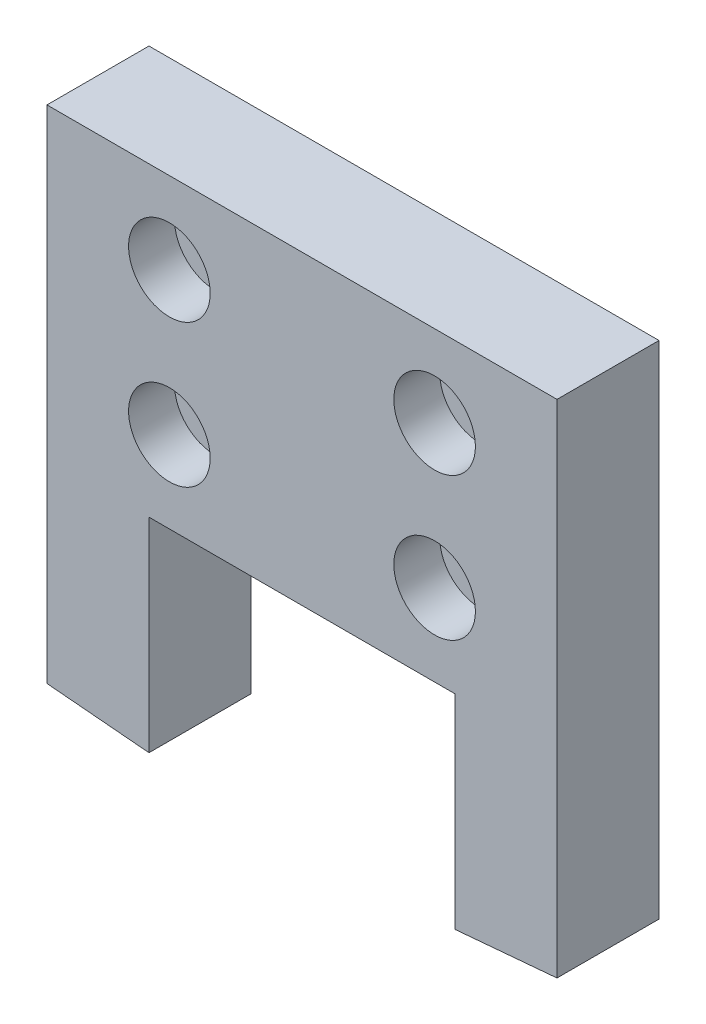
ISO-10303-21;
HEADER;
FILE_DESCRIPTION(('STEP AP214'),'2;1');
FILE_NAME('part.step','',(''),(''),'','','');
FILE_SCHEMA(('AUTOMOTIVE_DESIGN { 1 0 10303 214 1 1 1 1 }'));
ENDSEC;
DATA;
#1=APPLICATION_CONTEXT('core data for automotive mechanical design processes');
#2=APPLICATION_PROTOCOL_DEFINITION('international standard','automotive_design',2000,#1);
#3=PRODUCT_CONTEXT('',#1,'mechanical');
#4=PRODUCT('Part','Part','',(#3));
#5=PRODUCT_RELATED_PRODUCT_CATEGORY('part','',(#4));
#6=PRODUCT_DEFINITION_FORMATION('','',#4);
#7=PRODUCT_DEFINITION_CONTEXT('part definition',#1,'design');
#8=PRODUCT_DEFINITION('design','',#6,#7);
#9=PRODUCT_DEFINITION_SHAPE('','',#8);
#10=(LENGTH_UNIT() NAMED_UNIT(*) SI_UNIT(.MILLI.,.METRE.));
#11=(NAMED_UNIT(*) PLANE_ANGLE_UNIT() SI_UNIT($,.RADIAN.));
#12=(NAMED_UNIT(*) SI_UNIT($,.STERADIAN.) SOLID_ANGLE_UNIT());
#13=UNCERTAINTY_MEASURE_WITH_UNIT(LENGTH_MEASURE(1.E-05),#10,'distance_accuracy_value','');
#14=(GEOMETRIC_REPRESENTATION_CONTEXT(3) GLOBAL_UNCERTAINTY_ASSIGNED_CONTEXT((#13)) GLOBAL_UNIT_ASSIGNED_CONTEXT((#10,
#11,#12)) REPRESENTATION_CONTEXT('',''));
#15=CARTESIAN_POINT('',(0.,0.,0.));
#16=DIRECTION('',(0.,0.,1.));
#17=DIRECTION('',(1.,0.,0.));
#18=AXIS2_PLACEMENT_3D('',#15,#16,#17);
#19=CARTESIAN_POINT('',(12.,28.,10.));
#20=DIRECTION('',(0.,0.,-1.));
#21=DIRECTION('',(-1.,0.,0.));
#22=AXIS2_PLACEMENT_3D('',#19,#20,#21);
#23=CYLINDRICAL_SURFACE('',#22,2.25);
#24=CARTESIAN_POINT('',(12.,28.,0.));
#25=DIRECTION('',(0.,0.,1.));
#26=DIRECTION('',(1.,0.,0.));
#27=AXIS2_PLACEMENT_3D('',#24,#25,#26);
#28=CIRCLE('',#27,2.25);
#29=CARTESIAN_POINT('',(14.25,28.,0.));
#30=VERTEX_POINT('',#29);
#31=EDGE_CURVE('E161',#30,#30,#28,.T.);
#32=ORIENTED_EDGE('',*,*,#31,.F.);
#33=EDGE_LOOP('',(#32));
#34=FACE_BOUND('',#33,.T.);
#35=CARTESIAN_POINT('',(12.,28.,5.5));
#36=DIRECTION('',(0.,0.,1.));
#37=DIRECTION('',(1.,0.,0.));
#38=AXIS2_PLACEMENT_3D('',#35,#36,#37);
#39=CIRCLE('',#38,2.25);
#40=CARTESIAN_POINT('',(14.25,28.,5.5));
#41=VERTEX_POINT('',#40);
#42=EDGE_CURVE('E36',#41,#41,#39,.T.);
#43=ORIENTED_EDGE('',*,*,#42,.T.);
#44=EDGE_LOOP('',(#43));
#45=FACE_BOUND('',#44,.T.);
#46=ADVANCED_FACE('F32',(#34,#45),#23,.F.);
#47=CARTESIAN_POINT('',(38.,28.,10.));
#48=DIRECTION('',(0.,0.,-1.));
#49=DIRECTION('',(-1.,0.,0.));
#50=AXIS2_PLACEMENT_3D('',#47,#48,#49);
#51=CYLINDRICAL_SURFACE('',#50,2.25);
#52=CARTESIAN_POINT('',(38.,28.,0.));
#53=DIRECTION('',(0.,0.,1.));
#54=DIRECTION('',(1.,0.,0.));
#55=AXIS2_PLACEMENT_3D('',#52,#53,#54);
#56=CIRCLE('',#55,2.25);
#57=CARTESIAN_POINT('',(40.25,28.,0.));
#58=VERTEX_POINT('',#57);
#59=EDGE_CURVE('E194',#58,#58,#56,.T.);
#60=ORIENTED_EDGE('',*,*,#59,.F.);
#61=EDGE_LOOP('',(#60));
#62=FACE_BOUND('',#61,.T.);
#63=CARTESIAN_POINT('',(38.,28.,5.5));
#64=DIRECTION('',(0.,0.,1.));
#65=DIRECTION('',(1.,0.,0.));
#66=AXIS2_PLACEMENT_3D('',#63,#64,#65);
#67=CIRCLE('',#66,2.25);
#68=CARTESIAN_POINT('',(40.25,28.,5.5));
#69=VERTEX_POINT('',#68);
#70=EDGE_CURVE('E167',#69,#69,#67,.T.);
#71=ORIENTED_EDGE('',*,*,#70,.T.);
#72=EDGE_LOOP('',(#71));
#73=FACE_BOUND('',#72,.T.);
#74=ADVANCED_FACE('F239',(#62,#73),#51,.F.);
#75=CARTESIAN_POINT('',(38.,42.,10.));
#76=DIRECTION('',(0.,0.,-1.));
#77=DIRECTION('',(-1.,0.,0.));
#78=AXIS2_PLACEMENT_3D('',#75,#76,#77);
#79=CYLINDRICAL_SURFACE('',#78,2.25);
#80=CARTESIAN_POINT('',(38.,42.,0.));
#81=DIRECTION('',(0.,0.,1.));
#82=DIRECTION('',(1.,0.,0.));
#83=AXIS2_PLACEMENT_3D('',#80,#81,#82);
#84=CIRCLE('',#83,2.25);
#85=CARTESIAN_POINT('',(40.25,42.,0.));
#86=VERTEX_POINT('',#85);
#87=EDGE_CURVE('E197',#86,#86,#84,.T.);
#88=ORIENTED_EDGE('',*,*,#87,.F.);
#89=EDGE_LOOP('',(#88));
#90=FACE_BOUND('',#89,.T.);
#91=CARTESIAN_POINT('',(38.,42.,5.5));
#92=DIRECTION('',(0.,0.,1.));
#93=DIRECTION('',(1.,0.,0.));
#94=AXIS2_PLACEMENT_3D('',#91,#92,#93);
#95=CIRCLE('',#94,2.25);
#96=CARTESIAN_POINT('',(40.25,42.,5.5));
#97=VERTEX_POINT('',#96);
#98=EDGE_CURVE('E163',#97,#97,#95,.T.);
#99=ORIENTED_EDGE('',*,*,#98,.T.);
#100=EDGE_LOOP('',(#99));
#101=FACE_BOUND('',#100,.T.);
#102=ADVANCED_FACE('F245',(#90,#101),#79,.F.);
#103=CARTESIAN_POINT('',(12.,42.,10.));
#104=DIRECTION('',(0.,0.,-1.));
#105=DIRECTION('',(-1.,0.,0.));
#106=AXIS2_PLACEMENT_3D('',#103,#104,#105);
#107=CYLINDRICAL_SURFACE('',#106,2.25);
#108=CARTESIAN_POINT('',(12.,42.,0.));
#109=DIRECTION('',(0.,0.,1.));
#110=DIRECTION('',(1.,0.,0.));
#111=AXIS2_PLACEMENT_3D('',#108,#109,#110);
#112=CIRCLE('',#111,2.25);
#113=CARTESIAN_POINT('',(14.25,42.,0.));
#114=VERTEX_POINT('',#113);
#115=EDGE_CURVE('E135',#114,#114,#112,.T.);
#116=ORIENTED_EDGE('',*,*,#115,.F.);
#117=EDGE_LOOP('',(#116));
#118=FACE_BOUND('',#117,.T.);
#119=CARTESIAN_POINT('',(12.,42.,5.5));
#120=DIRECTION('',(0.,0.,1.));
#121=DIRECTION('',(1.,0.,0.));
#122=AXIS2_PLACEMENT_3D('',#119,#120,#121);
#123=CIRCLE('',#122,2.25);
#124=CARTESIAN_POINT('',(14.25,42.,5.5));
#125=VERTEX_POINT('',#124);
#126=EDGE_CURVE('E158',#125,#125,#123,.T.);
#127=ORIENTED_EDGE('',*,*,#126,.T.);
#128=EDGE_LOOP('',(#127));
#129=FACE_BOUND('',#128,.T.);
#130=ADVANCED_FACE('F254',(#118,#129),#107,.F.);
#131=CARTESIAN_POINT('',(0.,50.,10.));
#132=DIRECTION('',(0.,0.,-1.));
#133=DIRECTION('',(-1.,0.,0.));
#134=AXIS2_PLACEMENT_3D('',#131,#132,#133);
#135=PLANE('',#134);
#136=CARTESIAN_POINT('',(12.,28.,10.));
#137=DIRECTION('',(0.,0.,1.));
#138=DIRECTION('',(1.,0.,0.));
#139=AXIS2_PLACEMENT_3D('',#136,#137,#138);
#140=CIRCLE('',#139,4.);
#141=CARTESIAN_POINT('',(16.,28.,10.));
#142=VERTEX_POINT('',#141);
#143=EDGE_CURVE('E183',#142,#142,#140,.T.);
#144=ORIENTED_EDGE('',*,*,#143,.F.);
#145=EDGE_LOOP('',(#144));
#146=FACE_BOUND('',#145,.T.);
#147=CARTESIAN_POINT('',(38.,28.,10.));
#148=DIRECTION('',(0.,0.,1.));
#149=DIRECTION('',(1.,0.,0.));
#150=AXIS2_PLACEMENT_3D('',#147,#148,#149);
#151=CIRCLE('',#150,4.);
#152=CARTESIAN_POINT('',(42.,28.,10.));
#153=VERTEX_POINT('',#152);
#154=EDGE_CURVE('E176',#153,#153,#151,.T.);
#155=ORIENTED_EDGE('',*,*,#154,.F.);
#156=EDGE_LOOP('',(#155));
#157=FACE_BOUND('',#156,.T.);
#158=CARTESIAN_POINT('',(38.,42.,10.));
#159=DIRECTION('',(0.,0.,1.));
#160=DIRECTION('',(1.,0.,0.));
#161=AXIS2_PLACEMENT_3D('',#158,#159,#160);
#162=CIRCLE('',#161,4.);
#163=CARTESIAN_POINT('',(42.,42.,10.));
#164=VERTEX_POINT('',#163);
#165=EDGE_CURVE('E169',#164,#164,#162,.T.);
#166=ORIENTED_EDGE('',*,*,#165,.F.);
#167=EDGE_LOOP('',(#166));
#168=FACE_BOUND('',#167,.T.);
#169=CARTESIAN_POINT('',(12.,42.,10.));
#170=DIRECTION('',(0.,0.,1.));
#171=DIRECTION('',(1.,0.,0.));
#172=AXIS2_PLACEMENT_3D('',#169,#170,#171);
#173=CIRCLE('',#172,4.);
#174=CARTESIAN_POINT('',(16.,42.,10.));
#175=VERTEX_POINT('',#174);
#176=EDGE_CURVE('E165',#175,#175,#173,.T.);
#177=ORIENTED_EDGE('',*,*,#176,.F.);
#178=EDGE_LOOP('',(#177));
#179=FACE_BOUND('',#178,.T.);
#180=DIRECTION('',(0.,-1.,0.));
#181=VECTOR('',#180,1.);
#182=CARTESIAN_POINT('',(0.,0.874886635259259,10.));
#183=LINE('',#182,#181);
#184=CARTESIAN_POINT('',(0.,50.,10.));
#185=VERTEX_POINT('',#184);
#186=CARTESIAN_POINT('',(0.,0.874886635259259,10.));
#187=VERTEX_POINT('',#186);
#188=EDGE_CURVE('E146',#185,#187,#183,.T.);
#189=ORIENTED_EDGE('',*,*,#188,.T.);
#190=DIRECTION('',(0.996194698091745,-0.08715574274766,0.));
#191=VECTOR('',#190,1.);
#192=CARTESIAN_POINT('',(0.,0.874886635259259,10.));
#193=LINE('',#192,#191);
#194=CARTESIAN_POINT('',(10.,0.,10.));
#195=VERTEX_POINT('',#194);
#196=EDGE_CURVE('E94',#187,#195,#193,.T.);
#197=ORIENTED_EDGE('',*,*,#196,.T.);
#198=DIRECTION('',(0.,1.,0.));
#199=VECTOR('',#198,1.);
#200=CARTESIAN_POINT('',(10.,0.,10.));
#201=LINE('',#200,#199);
#202=CARTESIAN_POINT('',(10.,20.,10.));
#203=VERTEX_POINT('',#202);
#204=EDGE_CURVE('E204',#195,#203,#201,.T.);
#205=ORIENTED_EDGE('',*,*,#204,.T.);
#206=DIRECTION('',(1.,0.,0.));
#207=VECTOR('',#206,1.);
#208=CARTESIAN_POINT('',(10.,20.,10.));
#209=LINE('',#208,#207);
#210=CARTESIAN_POINT('',(40.,20.,10.));
#211=VERTEX_POINT('',#210);
#212=EDGE_CURVE('E206',#203,#211,#209,.T.);
#213=ORIENTED_EDGE('',*,*,#212,.T.);
#214=DIRECTION('',(0.,-1.,0.));
#215=VECTOR('',#214,1.);
#216=CARTESIAN_POINT('',(40.,0.,10.));
#217=LINE('',#216,#215);
#218=CARTESIAN_POINT('',(40.,0.,10.));
#219=VERTEX_POINT('',#218);
#220=EDGE_CURVE('E113',#211,#219,#217,.T.);
#221=ORIENTED_EDGE('',*,*,#220,.T.);
#222=DIRECTION('',(0.996194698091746,0.0871557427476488,0.));
#223=VECTOR('',#222,1.);
#224=CARTESIAN_POINT('',(40.,0.,10.));
#225=LINE('',#224,#223);
#226=CARTESIAN_POINT('',(50.,0.874886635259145,10.));
#227=VERTEX_POINT('',#226);
#228=EDGE_CURVE('E107',#219,#227,#225,.T.);
#229=ORIENTED_EDGE('',*,*,#228,.T.);
#230=DIRECTION('',(0.,1.,0.));
#231=VECTOR('',#230,1.);
#232=CARTESIAN_POINT('',(50.,0.874886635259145,10.));
#233=LINE('',#232,#231);
#234=CARTESIAN_POINT('',(50.,50.,10.));
#235=VERTEX_POINT('',#234);
#236=EDGE_CURVE('E111',#227,#235,#233,.T.);
#237=ORIENTED_EDGE('',*,*,#236,.T.);
#238=DIRECTION('',(-1.,0.,0.));
#239=VECTOR('',#238,1.);
#240=CARTESIAN_POINT('',(0.,50.,10.));
#241=LINE('',#240,#239);
#242=EDGE_CURVE('E51',#235,#185,#241,.T.);
#243=ORIENTED_EDGE('',*,*,#242,.T.);
#244=EDGE_LOOP('',(#189,#197,#205,#213,#221,#229,#237,#243));
#245=FACE_BOUND('',#244,.T.);
#246=ADVANCED_FACE('F109',(#146,#157,#168,#179,#245),#135,.F.);
#247=CARTESIAN_POINT('',(0.,50.,0.));
#248=DIRECTION('',(0.,0.,-1.));
#249=DIRECTION('',(-1.,0.,0.));
#250=AXIS2_PLACEMENT_3D('',#247,#248,#249);
#251=PLANE('',#250);
#252=ORIENTED_EDGE('',*,*,#59,.T.);
#253=EDGE_LOOP('',(#252));
#254=FACE_BOUND('',#253,.T.);
#255=ORIENTED_EDGE('',*,*,#115,.T.);
#256=EDGE_LOOP('',(#255));
#257=FACE_BOUND('',#256,.T.);
#258=DIRECTION('',(0.,-1.,0.));
#259=VECTOR('',#258,1.);
#260=CARTESIAN_POINT('',(0.,0.874886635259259,0.));
#261=LINE('',#260,#259);
#262=CARTESIAN_POINT('',(0.,50.,0.));
#263=VERTEX_POINT('',#262);
#264=CARTESIAN_POINT('',(0.,0.874886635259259,0.));
#265=VERTEX_POINT('',#264);
#266=EDGE_CURVE('E131',#263,#265,#261,.T.);
#267=ORIENTED_EDGE('',*,*,#266,.F.);
#268=DIRECTION('',(-1.,0.,0.));
#269=VECTOR('',#268,1.);
#270=CARTESIAN_POINT('',(0.,50.,0.));
#271=LINE('',#270,#269);
#272=CARTESIAN_POINT('',(50.,50.,0.));
#273=VERTEX_POINT('',#272);
#274=EDGE_CURVE('E86',#273,#263,#271,.T.);
#275=ORIENTED_EDGE('',*,*,#274,.F.);
#276=DIRECTION('',(0.,1.,0.));
#277=VECTOR('',#276,1.);
#278=CARTESIAN_POINT('',(50.,0.874886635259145,0.));
#279=LINE('',#278,#277);
#280=CARTESIAN_POINT('',(50.,0.874886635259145,0.));
#281=VERTEX_POINT('',#280);
#282=EDGE_CURVE('E80',#281,#273,#279,.T.);
#283=ORIENTED_EDGE('',*,*,#282,.F.);
#284=DIRECTION('',(0.996194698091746,0.0871557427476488,0.));
#285=VECTOR('',#284,1.);
#286=CARTESIAN_POINT('',(40.,0.,0.));
#287=LINE('',#286,#285);
#288=CARTESIAN_POINT('',(40.,0.,0.));
#289=VERTEX_POINT('',#288);
#290=EDGE_CURVE('E121',#289,#281,#287,.T.);
#291=ORIENTED_EDGE('',*,*,#290,.F.);
#292=DIRECTION('',(0.,-1.,0.));
#293=VECTOR('',#292,1.);
#294=CARTESIAN_POINT('',(40.,0.,0.));
#295=LINE('',#294,#293);
#296=CARTESIAN_POINT('',(40.,20.,0.));
#297=VERTEX_POINT('',#296);
#298=EDGE_CURVE('E141',#297,#289,#295,.T.);
#299=ORIENTED_EDGE('',*,*,#298,.F.);
#300=DIRECTION('',(1.,0.,0.));
#301=VECTOR('',#300,1.);
#302=CARTESIAN_POINT('',(10.,20.,0.));
#303=LINE('',#302,#301);
#304=CARTESIAN_POINT('',(10.,20.,0.));
#305=VERTEX_POINT('',#304);
#306=EDGE_CURVE('E139',#305,#297,#303,.T.);
#307=ORIENTED_EDGE('',*,*,#306,.F.);
#308=DIRECTION('',(0.,1.,0.));
#309=VECTOR('',#308,1.);
#310=CARTESIAN_POINT('',(10.,0.,0.));
#311=LINE('',#310,#309);
#312=CARTESIAN_POINT('',(10.,0.,0.));
#313=VERTEX_POINT('',#312);
#314=EDGE_CURVE('E137',#313,#305,#311,.T.);
#315=ORIENTED_EDGE('',*,*,#314,.F.);
#316=DIRECTION('',(0.996194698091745,-0.08715574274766,0.));
#317=VECTOR('',#316,1.);
#318=CARTESIAN_POINT('',(0.,0.874886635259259,0.));
#319=LINE('',#318,#317);
#320=EDGE_CURVE('E134',#265,#313,#319,.T.);
#321=ORIENTED_EDGE('',*,*,#320,.F.);
#322=EDGE_LOOP('',(#267,#275,#283,#291,#299,#307,#315,#321));
#323=FACE_BOUND('',#322,.T.);
#324=ORIENTED_EDGE('',*,*,#87,.T.);
#325=EDGE_LOOP('',(#324));
#326=FACE_BOUND('',#325,.T.);
#327=ORIENTED_EDGE('',*,*,#31,.T.);
#328=EDGE_LOOP('',(#327));
#329=FACE_BOUND('',#328,.T.);
#330=ADVANCED_FACE('F219',(#254,#257,#323,#326,#329),#251,.T.);
#331=CARTESIAN_POINT('',(0.,0.874886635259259,10.));
#332=DIRECTION('',(1.,0.,0.));
#333=DIRECTION('',(0.,0.,-1.));
#334=AXIS2_PLACEMENT_3D('',#331,#332,#333);
#335=PLANE('',#334);
#336=ORIENTED_EDGE('',*,*,#266,.T.);
#337=DIRECTION('',(0.,0.,-1.));
#338=VECTOR('',#337,1.);
#339=CARTESIAN_POINT('',(0.,0.874886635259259,10.));
#340=LINE('',#339,#338);
#341=EDGE_CURVE('E11',#187,#265,#340,.T.);
#342=ORIENTED_EDGE('',*,*,#341,.F.);
#343=ORIENTED_EDGE('',*,*,#188,.F.);
#344=DIRECTION('',(0.,0.,-1.));
#345=VECTOR('',#344,1.);
#346=CARTESIAN_POINT('',(0.,50.,10.));
#347=LINE('',#346,#345);
#348=EDGE_CURVE('E127',#185,#263,#347,.T.);
#349=ORIENTED_EDGE('',*,*,#348,.T.);
#350=EDGE_LOOP('',(#336,#342,#343,#349));
#351=FACE_BOUND('',#350,.T.);
#352=ADVANCED_FACE('F34',(#351),#335,.F.);
#353=CARTESIAN_POINT('',(0.,0.874886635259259,10.));
#354=DIRECTION('',(0.08715574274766,0.996194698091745,0.));
#355=DIRECTION('',(-0.996194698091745,0.08715574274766,0.));
#356=AXIS2_PLACEMENT_3D('',#353,#354,#355);
#357=PLANE('',#356);
#358=ORIENTED_EDGE('',*,*,#320,.T.);
#359=DIRECTION('',(0.,0.,-1.));
#360=VECTOR('',#359,1.);
#361=CARTESIAN_POINT('',(10.,0.,10.));
#362=LINE('',#361,#360);
#363=EDGE_CURVE('E42',#195,#313,#362,.T.);
#364=ORIENTED_EDGE('',*,*,#363,.F.);
#365=ORIENTED_EDGE('',*,*,#196,.F.);
#366=ORIENTED_EDGE('',*,*,#341,.T.);
#367=EDGE_LOOP('',(#358,#364,#365,#366));
#368=FACE_BOUND('',#367,.T.);
#369=ADVANCED_FACE('F266',(#368),#357,.F.);
#370=CARTESIAN_POINT('',(10.,0.,10.));
#371=DIRECTION('',(-1.,0.,0.));
#372=DIRECTION('',(0.,0.,1.));
#373=AXIS2_PLACEMENT_3D('',#370,#371,#372);
#374=PLANE('',#373);
#375=ORIENTED_EDGE('',*,*,#314,.T.);
#376=DIRECTION('',(0.,0.,-1.));
#377=VECTOR('',#376,1.);
#378=CARTESIAN_POINT('',(10.,20.,10.));
#379=LINE('',#378,#377);
#380=EDGE_CURVE('E153',#203,#305,#379,.T.);
#381=ORIENTED_EDGE('',*,*,#380,.F.);
#382=ORIENTED_EDGE('',*,*,#204,.F.);
#383=ORIENTED_EDGE('',*,*,#363,.T.);
#384=EDGE_LOOP('',(#375,#381,#382,#383));
#385=FACE_BOUND('',#384,.T.);
#386=ADVANCED_FACE('F416',(#385),#374,.F.);
#387=CARTESIAN_POINT('',(10.,20.,10.));
#388=DIRECTION('',(0.,1.,0.));
#389=DIRECTION('',(0.,0.,1.));
#390=AXIS2_PLACEMENT_3D('',#387,#388,#389);
#391=PLANE('',#390);
#392=ORIENTED_EDGE('',*,*,#306,.T.);
#393=DIRECTION('',(0.,0.,-1.));
#394=VECTOR('',#393,1.);
#395=CARTESIAN_POINT('',(40.,20.,10.));
#396=LINE('',#395,#394);
#397=EDGE_CURVE('E150',#211,#297,#396,.T.);
#398=ORIENTED_EDGE('',*,*,#397,.F.);
#399=ORIENTED_EDGE('',*,*,#212,.F.);
#400=ORIENTED_EDGE('',*,*,#380,.T.);
#401=EDGE_LOOP('',(#392,#398,#399,#400));
#402=FACE_BOUND('',#401,.T.);
#403=ADVANCED_FACE('F212',(#402),#391,.F.);
#404=CARTESIAN_POINT('',(40.,0.,10.));
#405=DIRECTION('',(1.,0.,0.));
#406=DIRECTION('',(0.,0.,-1.));
#407=AXIS2_PLACEMENT_3D('',#404,#405,#406);
#408=PLANE('',#407);
#409=ORIENTED_EDGE('',*,*,#298,.T.);
#410=DIRECTION('',(0.,0.,-1.));
#411=VECTOR('',#410,1.);
#412=CARTESIAN_POINT('',(40.,0.,10.));
#413=LINE('',#412,#411);
#414=EDGE_CURVE('E122',#219,#289,#413,.T.);
#415=ORIENTED_EDGE('',*,*,#414,.F.);
#416=ORIENTED_EDGE('',*,*,#220,.F.);
#417=ORIENTED_EDGE('',*,*,#397,.T.);
#418=EDGE_LOOP('',(#409,#415,#416,#417));
#419=FACE_BOUND('',#418,.T.);
#420=ADVANCED_FACE('F216',(#419),#408,.F.);
#421=CARTESIAN_POINT('',(40.,0.,10.));
#422=DIRECTION('',(-0.0871557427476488,0.996194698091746,0.));
#423=DIRECTION('',(-0.996194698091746,-0.0871557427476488,0.));
#424=AXIS2_PLACEMENT_3D('',#421,#422,#423);
#425=PLANE('',#424);
#426=ORIENTED_EDGE('',*,*,#290,.T.);
#427=DIRECTION('',(0.,0.,-1.));
#428=VECTOR('',#427,1.);
#429=CARTESIAN_POINT('',(50.,0.874886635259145,10.));
#430=LINE('',#429,#428);
#431=EDGE_CURVE('E118',#227,#281,#430,.T.);
#432=ORIENTED_EDGE('',*,*,#431,.F.);
#433=ORIENTED_EDGE('',*,*,#228,.F.);
#434=ORIENTED_EDGE('',*,*,#414,.T.);
#435=EDGE_LOOP('',(#426,#432,#433,#434));
#436=FACE_BOUND('',#435,.T.);
#437=ADVANCED_FACE('F119',(#436),#425,.F.);
#438=CARTESIAN_POINT('',(50.,0.874886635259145,10.));
#439=DIRECTION('',(-1.,0.,0.));
#440=DIRECTION('',(0.,0.,1.));
#441=AXIS2_PLACEMENT_3D('',#438,#439,#440);
#442=PLANE('',#441);
#443=ORIENTED_EDGE('',*,*,#282,.T.);
#444=DIRECTION('',(0.,0.,-1.));
#445=VECTOR('',#444,1.);
#446=CARTESIAN_POINT('',(50.,50.,10.));
#447=LINE('',#446,#445);
#448=EDGE_CURVE('E123',#235,#273,#447,.T.);
#449=ORIENTED_EDGE('',*,*,#448,.F.);
#450=ORIENTED_EDGE('',*,*,#236,.F.);
#451=ORIENTED_EDGE('',*,*,#431,.T.);
#452=EDGE_LOOP('',(#443,#449,#450,#451));
#453=FACE_BOUND('',#452,.T.);
#454=ADVANCED_FACE('F125',(#453),#442,.F.);
#455=CARTESIAN_POINT('',(0.,50.,10.));
#456=DIRECTION('',(0.,-1.,0.));
#457=DIRECTION('',(0.,0.,-1.));
#458=AXIS2_PLACEMENT_3D('',#455,#456,#457);
#459=PLANE('',#458);
#460=ORIENTED_EDGE('',*,*,#274,.T.);
#461=ORIENTED_EDGE('',*,*,#348,.F.);
#462=ORIENTED_EDGE('',*,*,#242,.F.);
#463=ORIENTED_EDGE('',*,*,#448,.T.);
#464=EDGE_LOOP('',(#460,#461,#462,#463));
#465=FACE_BOUND('',#464,.T.);
#466=ADVANCED_FACE('F225',(#465),#459,.F.);
#467=CARTESIAN_POINT('',(12.,42.,5.5));
#468=DIRECTION('',(0.,0.,1.));
#469=DIRECTION('',(1.,0.,0.));
#470=AXIS2_PLACEMENT_3D('',#467,#468,#469);
#471=CYLINDRICAL_SURFACE('',#470,4.);
#472=CARTESIAN_POINT('',(12.,42.,5.5));
#473=DIRECTION('',(0.,0.,1.));
#474=DIRECTION('',(1.,0.,0.));
#475=AXIS2_PLACEMENT_3D('',#472,#473,#474);
#476=CIRCLE('',#475,4.);
#477=CARTESIAN_POINT('',(16.,42.,5.5));
#478=VERTEX_POINT('',#477);
#479=EDGE_CURVE('E162',#478,#478,#476,.T.);
#480=ORIENTED_EDGE('',*,*,#479,.F.);
#481=EDGE_LOOP('',(#480));
#482=FACE_BOUND('',#481,.T.);
#483=ORIENTED_EDGE('',*,*,#176,.T.);
#484=EDGE_LOOP('',(#483));
#485=FACE_BOUND('',#484,.T.);
#486=ADVANCED_FACE('F227',(#482,#485),#471,.F.);
#487=CARTESIAN_POINT('',(12.,42.,5.5));
#488=DIRECTION('',(0.,0.,1.));
#489=DIRECTION('',(1.,0.,0.));
#490=AXIS2_PLACEMENT_3D('',#487,#488,#489);
#491=PLANE('',#490);
#492=ORIENTED_EDGE('',*,*,#126,.F.);
#493=EDGE_LOOP('',(#492));
#494=FACE_BOUND('',#493,.T.);
#495=ORIENTED_EDGE('',*,*,#479,.T.);
#496=EDGE_LOOP('',(#495));
#497=FACE_BOUND('',#496,.T.);
#498=ADVANCED_FACE('F233',(#494,#497),#491,.T.);
#499=CARTESIAN_POINT('',(38.,42.,5.5));
#500=DIRECTION('',(0.,0.,1.));
#501=DIRECTION('',(1.,0.,0.));
#502=AXIS2_PLACEMENT_3D('',#499,#500,#501);
#503=CYLINDRICAL_SURFACE('',#502,4.);
#504=CARTESIAN_POINT('',(38.,42.,5.5));
#505=DIRECTION('',(0.,0.,1.));
#506=DIRECTION('',(1.,0.,0.));
#507=AXIS2_PLACEMENT_3D('',#504,#505,#506);
#508=CIRCLE('',#507,4.);
#509=CARTESIAN_POINT('',(42.,42.,5.5));
#510=VERTEX_POINT('',#509);
#511=EDGE_CURVE('E166',#510,#510,#508,.T.);
#512=ORIENTED_EDGE('',*,*,#511,.F.);
#513=EDGE_LOOP('',(#512));
#514=FACE_BOUND('',#513,.T.);
#515=ORIENTED_EDGE('',*,*,#165,.T.);
#516=EDGE_LOOP('',(#515));
#517=FACE_BOUND('',#516,.T.);
#518=ADVANCED_FACE('F275',(#514,#517),#503,.F.);
#519=CARTESIAN_POINT('',(38.,42.,5.5));
#520=DIRECTION('',(0.,0.,1.));
#521=DIRECTION('',(1.,0.,0.));
#522=AXIS2_PLACEMENT_3D('',#519,#520,#521);
#523=PLANE('',#522);
#524=ORIENTED_EDGE('',*,*,#98,.F.);
#525=EDGE_LOOP('',(#524));
#526=FACE_BOUND('',#525,.T.);
#527=ORIENTED_EDGE('',*,*,#511,.T.);
#528=EDGE_LOOP('',(#527));
#529=FACE_BOUND('',#528,.T.);
#530=ADVANCED_FACE('F283',(#526,#529),#523,.T.);
#531=CARTESIAN_POINT('',(38.,28.,5.5));
#532=DIRECTION('',(0.,0.,1.));
#533=DIRECTION('',(1.,0.,0.));
#534=AXIS2_PLACEMENT_3D('',#531,#532,#533);
#535=CYLINDRICAL_SURFACE('',#534,4.);
#536=CARTESIAN_POINT('',(38.,28.,5.5));
#537=DIRECTION('',(0.,0.,1.));
#538=DIRECTION('',(1.,0.,0.));
#539=AXIS2_PLACEMENT_3D('',#536,#537,#538);
#540=CIRCLE('',#539,4.);
#541=CARTESIAN_POINT('',(42.,28.,5.5));
#542=VERTEX_POINT('',#541);
#543=EDGE_CURVE('E170',#542,#542,#540,.T.);
#544=ORIENTED_EDGE('',*,*,#543,.F.);
#545=EDGE_LOOP('',(#544));
#546=FACE_BOUND('',#545,.T.);
#547=ORIENTED_EDGE('',*,*,#154,.T.);
#548=EDGE_LOOP('',(#547));
#549=FACE_BOUND('',#548,.T.);
#550=ADVANCED_FACE('F289',(#546,#549),#535,.F.);
#551=CARTESIAN_POINT('',(38.,28.,5.5));
#552=DIRECTION('',(0.,0.,1.));
#553=DIRECTION('',(1.,0.,0.));
#554=AXIS2_PLACEMENT_3D('',#551,#552,#553);
#555=PLANE('',#554);
#556=ORIENTED_EDGE('',*,*,#70,.F.);
#557=EDGE_LOOP('',(#556));
#558=FACE_BOUND('',#557,.T.);
#559=ORIENTED_EDGE('',*,*,#543,.T.);
#560=EDGE_LOOP('',(#559));
#561=FACE_BOUND('',#560,.T.);
#562=ADVANCED_FACE('F293',(#558,#561),#555,.T.);
#563=CARTESIAN_POINT('',(12.,28.,5.5));
#564=DIRECTION('',(0.,0.,1.));
#565=DIRECTION('',(1.,0.,0.));
#566=AXIS2_PLACEMENT_3D('',#563,#564,#565);
#567=CYLINDRICAL_SURFACE('',#566,4.);
#568=CARTESIAN_POINT('',(12.,28.,5.5));
#569=DIRECTION('',(0.,0.,1.));
#570=DIRECTION('',(1.,0.,0.));
#571=AXIS2_PLACEMENT_3D('',#568,#569,#570);
#572=CIRCLE('',#571,4.);
#573=CARTESIAN_POINT('',(16.,28.,5.5));
#574=VERTEX_POINT('',#573);
#575=EDGE_CURVE('E312',#574,#574,#572,.T.);
#576=ORIENTED_EDGE('',*,*,#575,.F.);
#577=EDGE_LOOP('',(#576));
#578=FACE_BOUND('',#577,.T.);
#579=ORIENTED_EDGE('',*,*,#143,.T.);
#580=EDGE_LOOP('',(#579));
#581=FACE_BOUND('',#580,.T.);
#582=ADVANCED_FACE('F297',(#578,#581),#567,.F.);
#583=CARTESIAN_POINT('',(12.,28.,5.5));
#584=DIRECTION('',(0.,0.,1.));
#585=DIRECTION('',(1.,0.,0.));
#586=AXIS2_PLACEMENT_3D('',#583,#584,#585);
#587=PLANE('',#586);
#588=ORIENTED_EDGE('',*,*,#42,.F.);
#589=EDGE_LOOP('',(#588));
#590=FACE_BOUND('',#589,.T.);
#591=ORIENTED_EDGE('',*,*,#575,.T.);
#592=EDGE_LOOP('',(#591));
#593=FACE_BOUND('',#592,.T.);
#594=ADVANCED_FACE('F301',(#590,#593),#587,.T.);
#595=CLOSED_SHELL('',(#46,#74,#102,#130,#246,#330,#352,#369,#386,#403,#420,#437,#454,#466,#486,
#498,#518,#530,#550,#562,#582,#594));
#596=MANIFOLD_SOLID_BREP('B2',#595);
#597=ADVANCED_BREP_SHAPE_REPRESENTATION('',(#18,#596),#14);
#598=SHAPE_DEFINITION_REPRESENTATION(#9,#597);
ENDSEC;
END-ISO-10303-21;
